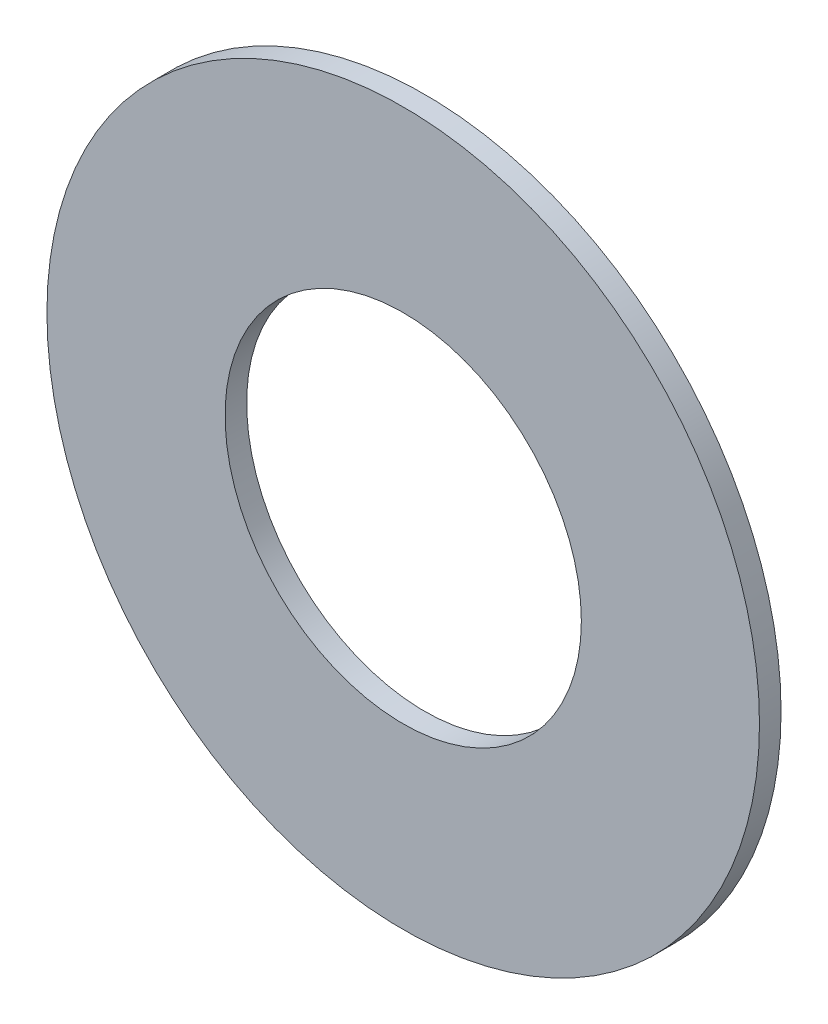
ISO-10303-21;
HEADER;
FILE_DESCRIPTION(('STEP AP214'),'2;1');
FILE_NAME('part.step','',(''),(''),'','','');
FILE_SCHEMA(('AUTOMOTIVE_DESIGN { 1 0 10303 214 1 1 1 1 }'));
ENDSEC;
DATA;
#1=APPLICATION_CONTEXT('core data for automotive mechanical design processes');
#2=APPLICATION_PROTOCOL_DEFINITION('international standard','automotive_design',2000,#1);
#3=PRODUCT_CONTEXT('',#1,'mechanical');
#4=PRODUCT('Part','Part','',(#3));
#5=PRODUCT_RELATED_PRODUCT_CATEGORY('part','',(#4));
#6=PRODUCT_DEFINITION_FORMATION('','',#4);
#7=PRODUCT_DEFINITION_CONTEXT('part definition',#1,'design');
#8=PRODUCT_DEFINITION('design','',#6,#7);
#9=PRODUCT_DEFINITION_SHAPE('','',#8);
#10=(LENGTH_UNIT() NAMED_UNIT(*) SI_UNIT(.MILLI.,.METRE.));
#11=(NAMED_UNIT(*) PLANE_ANGLE_UNIT() SI_UNIT($,.RADIAN.));
#12=(NAMED_UNIT(*) SI_UNIT($,.STERADIAN.) SOLID_ANGLE_UNIT());
#13=UNCERTAINTY_MEASURE_WITH_UNIT(LENGTH_MEASURE(1.E-05),#10,'distance_accuracy_value','');
#14=(GEOMETRIC_REPRESENTATION_CONTEXT(3) GLOBAL_UNCERTAINTY_ASSIGNED_CONTEXT((#13)) GLOBAL_UNIT_ASSIGNED_CONTEXT((#10,
#11,#12)) REPRESENTATION_CONTEXT('',''));
#15=CARTESIAN_POINT('',(0.,0.,0.));
#16=DIRECTION('',(0.,0.,1.));
#17=DIRECTION('',(1.,0.,0.));
#18=AXIS2_PLACEMENT_3D('',#15,#16,#17);
#19=CARTESIAN_POINT('',(0.,0.,2.));
#20=DIRECTION('',(0.,0.,1.));
#21=DIRECTION('',(1.,0.,0.));
#22=AXIS2_PLACEMENT_3D('',#19,#20,#21);
#23=PLANE('',#22);
#24=CARTESIAN_POINT('',(0.,0.,2.));
#25=DIRECTION('',(0.,0.,1.));
#26=DIRECTION('',(1.,0.,0.));
#27=AXIS2_PLACEMENT_3D('',#24,#25,#26);
#28=CIRCLE('',#27,33.);
#29=CARTESIAN_POINT('',(33.,0.,2.));
#30=VERTEX_POINT('',#29);
#31=EDGE_CURVE('E10',#30,#30,#28,.T.);
#32=ORIENTED_EDGE('',*,*,#31,.T.);
#33=EDGE_LOOP('',(#32));
#34=FACE_BOUND('',#33,.T.);
#35=CARTESIAN_POINT('',(0.,0.,2.));
#36=DIRECTION('',(0.,0.,1.));
#37=DIRECTION('',(1.,0.,0.));
#38=AXIS2_PLACEMENT_3D('',#35,#36,#37);
#39=CIRCLE('',#38,16.5);
#40=CARTESIAN_POINT('',(16.5,0.,2.));
#41=VERTEX_POINT('',#40);
#42=EDGE_CURVE('E43',#41,#41,#39,.T.);
#43=ORIENTED_EDGE('',*,*,#42,.F.);
#44=EDGE_LOOP('',(#43));
#45=FACE_BOUND('',#44,.T.);
#46=ADVANCED_FACE('F32',(#34,#45),#23,.T.);
#47=CARTESIAN_POINT('',(0.,0.,0.));
#48=DIRECTION('',(0.,0.,1.));
#49=DIRECTION('',(1.,0.,0.));
#50=AXIS2_PLACEMENT_3D('',#47,#48,#49);
#51=PLANE('',#50);
#52=CARTESIAN_POINT('',(0.,0.,0.));
#53=DIRECTION('',(0.,0.,1.));
#54=DIRECTION('',(1.,0.,0.));
#55=AXIS2_PLACEMENT_3D('',#52,#53,#54);
#56=CIRCLE('',#55,33.);
#57=CARTESIAN_POINT('',(33.,0.,0.));
#58=VERTEX_POINT('',#57);
#59=EDGE_CURVE('E36',#58,#58,#56,.T.);
#60=ORIENTED_EDGE('',*,*,#59,.F.);
#61=EDGE_LOOP('',(#60));
#62=FACE_BOUND('',#61,.T.);
#63=CARTESIAN_POINT('',(0.,0.,0.));
#64=DIRECTION('',(0.,0.,1.));
#65=DIRECTION('',(1.,0.,0.));
#66=AXIS2_PLACEMENT_3D('',#63,#64,#65);
#67=CIRCLE('',#66,16.5);
#68=CARTESIAN_POINT('',(16.5,0.,0.));
#69=VERTEX_POINT('',#68);
#70=EDGE_CURVE('E45',#69,#69,#67,.T.);
#71=ORIENTED_EDGE('',*,*,#70,.T.);
#72=EDGE_LOOP('',(#71));
#73=FACE_BOUND('',#72,.T.);
#74=ADVANCED_FACE('F55',(#62,#73),#51,.F.);
#75=CARTESIAN_POINT('',(0.,0.,2.));
#76=DIRECTION('',(0.,0.,-1.));
#77=DIRECTION('',(-1.,0.,0.));
#78=AXIS2_PLACEMENT_3D('',#75,#76,#77);
#79=CYLINDRICAL_SURFACE('',#78,33.);
#80=ORIENTED_EDGE('',*,*,#31,.F.);
#81=EDGE_LOOP('',(#80));
#82=FACE_BOUND('',#81,.T.);
#83=ORIENTED_EDGE('',*,*,#59,.T.);
#84=EDGE_LOOP('',(#83));
#85=FACE_BOUND('',#84,.T.);
#86=ADVANCED_FACE('F34',(#82,#85),#79,.T.);
#87=CARTESIAN_POINT('',(0.,0.,2.));
#88=DIRECTION('',(0.,0.,-1.));
#89=DIRECTION('',(-1.,0.,0.));
#90=AXIS2_PLACEMENT_3D('',#87,#88,#89);
#91=CYLINDRICAL_SURFACE('',#90,16.5);
#92=ORIENTED_EDGE('',*,*,#42,.T.);
#93=EDGE_LOOP('',(#92));
#94=FACE_BOUND('',#93,.T.);
#95=ORIENTED_EDGE('',*,*,#70,.F.);
#96=EDGE_LOOP('',(#95));
#97=FACE_BOUND('',#96,.T.);
#98=ADVANCED_FACE('F51',(#94,#97),#91,.F.);
#99=CLOSED_SHELL('',(#46,#74,#86,#98));
#100=MANIFOLD_SOLID_BREP('B2',#99);
#101=ADVANCED_BREP_SHAPE_REPRESENTATION('',(#18,#100),#14);
#102=SHAPE_DEFINITION_REPRESENTATION(#9,#101);
ENDSEC;
END-ISO-10303-21;
